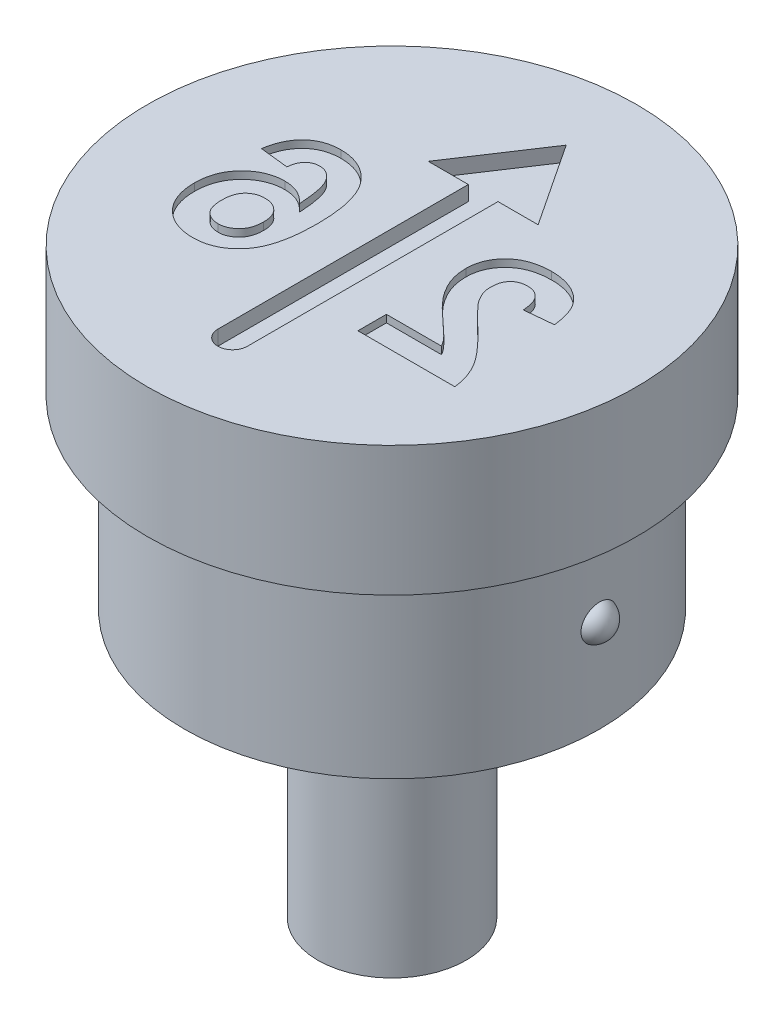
from build123d import *

# Parameters (mm, degrees)
CUT_EXTRUDE1_DEPTH = 0.4
CUT_EXTRUDE2_DEPTH = 0.2


with BuildPart() as part:
    # Sketch1 → Revolve1 (revolve)
    with BuildSketch(Plane.XY, mode=Mode.PRIVATE) as revolve1_sk:
        Polygon((0, 0), (-6.6, 0), (-6.6, -3.5), (-5.6, -3.5), (-5.6, -8.5), (-2, -8.5), (-2, -15.7), (0, -15.7), align=None)
    revolve(revolve1_sk.sketch.rotate(Axis((0, 0, 0), (0, -1, 0)), 270), axis=Axis((0, 0, 0), (0, -1, 0)))

    # Sketch3 → Cut-Extrude1 (cut)
    with BuildSketch(Plane(origin=(0, 0, 0), x_dir=(1, 0, 0), z_dir=(0, 1, 0))):
        with BuildLine():
            Line((0, 4.7), (-1.482623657, 2.46))
            Line((-1.482623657, 2.46), (-0.4, 2.46))
            Line((-0.4, 2.46), (-0.4, -4.3))
            ThreePointArc((-0.4, -4.3), (0, -4.7), (0.4, -4.3))
            Line((0.4, -4.3), (0.4, 2.46))
            Line((0.4, 2.46), (1.482623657, 2.46))
            Line((1.482623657, 2.46), (0, 4.7))
        make_face()
    extrude(amount=-CUT_EXTRUDE1_DEPTH, mode=Mode.SUBTRACT)

    # Sketch4 → Cut-Extrude2 (cut)
    # profile 1 of 2: a face of its own
    with BuildSketch(Plane(origin=(0, 0, 0), x_dir=(1, 0, 0), z_dir=(0, 1, 0))):
        with BuildLine():
            Line((1.528524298, -1.679177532), (1.528524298, -2.448408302))
            Line((1.528524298, -2.448408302), (4.143908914, -2.448408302))
            add(Edge.make_bspline(
                [(4.143908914, -2.448408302), (4.135053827, -2.382666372), (4.11734862, -2.251219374), (4.062610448, -2.059208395), (3.989553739, -1.871838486), (3.910264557, -1.719364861), (3.831402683, -1.596628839), (3.759851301, -1.496057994), (3.674493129, -1.389054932), (3.576566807, -1.274755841), (3.466613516, -1.152803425), (3.343812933, -1.023651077), (3.207579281, -0.887917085), (3.11173648, -0.795747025), (3.062178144, -0.748087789)],
                knots=[0, 0, 0, 0, 1.156289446, 2.311930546, 3.473459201, 4.661751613, 5.303057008, 6.018253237, 6.81459331, 7.690699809, 8.644447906, 9.679642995, 10.800191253, 12, 12, 12, 12], degree=3))
            add(Edge.make_bspline(
                [(3.062178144, -0.748087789), (3.022630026, -0.709913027), (2.947342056, -0.637239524), (2.840131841, -0.533174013), (2.745883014, -0.437508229), (2.662624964, -0.352721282), (2.592281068, -0.276654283), (2.533926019, -0.21050185), (2.486820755, -0.153994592), (2.461308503, -0.118146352), (2.449998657, -0.102254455)],
                knots=[0, 0, 0, 0, 1.480720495, 2.818855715, 4.024636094, 5.098235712, 6.019786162, 6.815086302, 7.474715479, 8, 8, 8, 8], degree=3))
            add(Edge.make_bspline(
                [(2.449998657, -0.102254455), (2.426838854, -0.063783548), (2.382166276, 0.010422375), (2.333179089, 0.127112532), (2.303775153, 0.243778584), (2.299740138, 0.321734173), (2.297755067, 0.360085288)],
                knots=[0, 0, 0, 0, 1.0911822, 2.104764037, 3.067617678, 4, 4, 4, 4], degree=3))
            add(Edge.make_bspline(
                [(2.297755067, 0.360085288), (2.299195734, 0.39999478), (2.301921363, 0.475500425), (2.324776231, 0.582052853), (2.36530563, 0.673649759), (2.421107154, 0.750572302), (2.491668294, 0.81084082), (2.574156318, 0.855373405), (2.669778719, 0.87999412), (2.736987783, 0.883232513), (2.772114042, 0.884925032)],
                knots=[0, 0, 0, 0, 1.193122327, 2.257294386, 3.237245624, 4.168877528, 5.075331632, 5.990371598, 6.949684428, 8, 8, 8, 8], degree=3))
            add(Edge.make_bspline(
                [(2.772114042, 0.884925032), (2.80700299, 0.883344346), (2.874400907, 0.880290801), (2.970187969, 0.853615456), (3.05398397, 0.807437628), (3.113701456, 0.754813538), (3.154043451, 0.703640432), (3.181531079, 0.659046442), (3.205223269, 0.608373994), (3.226216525, 0.552193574), (3.242798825, 0.489861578), (3.256153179, 0.421852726), (3.266914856, 0.347801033), (3.270337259, 0.29628539), (3.272114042, 0.269540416)],
                knots=[0, 0, 0, 0, 1.402788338, 2.709884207, 3.961032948, 5.225417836, 5.883680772, 6.578928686, 7.329201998, 8.132101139, 8.990263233, 9.922304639, 10.921339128, 12, 12, 12, 12], degree=3))
            Line((3.272114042, 0.269540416), (4.041344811, 0.344860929))
            add(Edge.make_bspline(
                [(4.041344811, 0.344860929), (4.035160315, 0.396793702), (4.023169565, 0.49748305), (3.993246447, 0.642107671), (3.955349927, 0.775530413), (3.90767335, 0.897503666), (3.852187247, 1.008803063), (3.786061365, 1.107758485), (3.711606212, 1.19546608), (3.628757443, 1.271879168), (3.538041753, 1.337240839), (3.442851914, 1.39558616), (3.34132765, 1.44344787), (3.234586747, 1.482893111), (3.122677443, 1.514417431), (3.005082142, 1.535260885), (2.882526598, 1.54992225), (2.798869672, 1.551026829), (2.756088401, 1.551591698)],
                knots=[0, 0, 0, 0, 1.270971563, 2.464210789, 3.586263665, 4.638946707, 5.643716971, 6.603612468, 7.52484387, 8.434700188, 9.336036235, 10.239171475, 11.145359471, 12.059630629, 13.003312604, 13.96741569, 14.960557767, 16, 16, 16, 16], degree=3))
            add(Edge.make_bspline(
                [(2.756088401, 1.551591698), (2.709579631, 1.550697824), (2.618997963, 1.548956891), (2.486764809, 1.534580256), (2.362541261, 1.50951251), (2.245241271, 1.476306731), (2.136069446, 1.431974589), (2.034116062, 1.378378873), (1.940985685, 1.313485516), (1.855290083, 1.24083343), (1.778685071, 1.160939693), (1.711586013, 1.075719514), (1.655370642, 0.985232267), (1.608197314, 0.890580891), (1.573171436, 0.790242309), (1.547650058, 0.685603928), (1.530728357, 0.576177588), (1.52926711, 0.50144188), (1.528524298, 0.463450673)],
                knots=[0, 0, 0, 0, 1.210756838, 2.35810096, 3.457354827, 4.507168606, 5.527358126, 6.519769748, 7.499700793, 8.476517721, 9.440526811, 10.376769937, 11.295256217, 12.209626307, 13.124630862, 14.055668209, 15.011616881, 16, 16, 16, 16], degree=3))
            add(Edge.make_bspline(
                [(1.528524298, 0.463450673), (1.529502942, 0.419848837), (1.531444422, 0.333349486), (1.550032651, 0.205477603), (1.578431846, 0.08055443), (1.620403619, -0.041725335), (1.6736061, -0.164294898), (1.742185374, -0.287429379), (1.821811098, -0.414842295), (1.884154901, -0.497220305), (1.916344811, -0.539754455)],
                knots=[0, 0, 0, 0, 0.953409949, 1.89141903, 2.821310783, 3.752688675, 4.715703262, 5.740811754, 6.833515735, 8, 8, 8, 8], degree=3))
            add(Edge.make_bspline(
                [(1.916344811, -0.539754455), (1.928511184, -0.555078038), (1.954568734, -0.587897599), (1.998899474, -0.638221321), (2.050274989, -0.69319069), (2.107969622, -0.753834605), (2.173889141, -0.818005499), (2.245661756, -0.888386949), (2.326445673, -0.96137871), (2.410118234, -1.038801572), (2.494154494, -1.114156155), (2.571395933, -1.185726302), (2.641556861, -1.249050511), (2.701369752, -1.307624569), (2.754352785, -1.357450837), (2.798596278, -1.40108435), (2.834928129, -1.437468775), (2.884991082, -1.494182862), (2.948690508, -1.570888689), (2.993505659, -1.644183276), (3.014902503, -1.679177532)],
                knots=[0, 0, 0, 0, 0.665555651, 1.425465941, 2.280616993, 3.225313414, 4.272635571, 5.410053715, 6.644756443, 7.976022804, 9.288331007, 10.484517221, 11.558462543, 12.503158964, 13.33222979, 14.032602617, 14.617328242, 15.080653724, 16.606167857, 18, 18, 18, 18], degree=3))
            Line((3.014902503, -1.679177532), (1.528524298, -1.679177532))
        make_face()
    # profile 2 of 2: a face of its own
    with BuildSketch(Plane(origin=(0, 0, 0), x_dir=(1, 0, 0), z_dir=(0, 1, 0))):
        with BuildLine():
            Line((-4.030450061, 0.507521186), (-3.261219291, 0.42338657))
            add(Edge.make_bspline(
                [(-3.261219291, 0.42338657), (-3.256065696, 0.460436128), (-3.24636757, 0.530156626), (-3.21764222, 0.626370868), (-3.177653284, 0.707311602), (-3.126323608, 0.773091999), (-3.065184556, 0.823719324), (-2.995519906, 0.859693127), (-2.917373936, 0.881048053), (-2.862585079, 0.883599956), (-2.834135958, 0.884925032)],
                knots=[0, 0, 0, 0, 1.280716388, 2.410074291, 3.425374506, 4.35753932, 5.248331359, 6.12451615, 7.026154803, 8, 8, 8, 8], degree=3))
            add(Edge.make_bspline(
                [(-2.834135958, 0.884925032), (-2.814843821, 0.884453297), (-2.776453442, 0.883514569), (-2.720533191, 0.871596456), (-2.666619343, 0.853909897), (-2.61515191, 0.828860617), (-2.565874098, 0.796539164), (-2.519535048, 0.756559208), (-2.47400436, 0.711028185), (-2.431961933, 0.65604734), (-2.391627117, 0.590946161), (-2.356897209, 0.51125004), (-2.325942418, 0.417033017), (-2.299438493, 0.307833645), (-2.275386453, 0.184345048), (-2.255670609, 0.046067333), (-2.239894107, -0.107123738), (-2.232325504, -0.214408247), (-2.228366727, -0.270523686)],
                knots=[0, 0, 0, 0, 0.642458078, 1.278459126, 1.898279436, 2.531842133, 3.181731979, 3.858193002, 4.57010051, 5.325711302, 6.161524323, 7.118599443, 8.217371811, 9.466325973, 10.864147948, 12.412648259, 14.123626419, 16, 16, 16, 16], degree=3))
            add(Edge.make_bspline(
                [(-2.228366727, -0.270523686), (-2.252951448, -0.24382144), (-2.301159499, -0.191461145), (-2.381151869, -0.123195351), (-2.46495578, -0.064832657), (-2.553483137, -0.016951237), (-2.647217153, 0.018680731), (-2.744459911, 0.045735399), (-2.846484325, 0.060890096), (-2.915819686, 0.063223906), (-2.951123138, 0.064412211)],
                knots=[0, 0, 0, 0, 1.057745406, 2.074127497, 3.059409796, 4.031705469, 5.000875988, 5.977809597, 6.970362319, 8, 8, 8, 8], degree=3))
            add(Edge.make_bspline(
                [(-2.951123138, 0.064412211), (-2.990966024, 0.063264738), (-3.069641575, 0.060998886), (-3.185548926, 0.045106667), (-3.296769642, 0.0165296), (-3.403806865, -0.022127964), (-3.50718962, -0.070807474), (-3.604940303, -0.132428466), (-3.698593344, -0.204275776), (-3.786860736, -0.286360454), (-3.867957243, -0.376728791), (-3.939557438, -0.474333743), (-3.998482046, -0.579473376), (-4.048855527, -0.68979377), (-4.08633532, -0.807472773), (-4.113541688, -0.930816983), (-4.129781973, -1.060958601), (-4.131919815, -1.149750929), (-4.133014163, -1.195203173)],
                knots=[0, 0, 0, 0, 0.99135015, 1.957564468, 2.903754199, 3.843479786, 4.78583385, 5.741106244, 6.712813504, 7.719198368, 8.735844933, 9.730198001, 10.724351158, 11.729813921, 12.742848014, 13.790983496, 14.86921809, 16, 16, 16, 16], degree=3))
            add(Edge.make_bspline(
                [(-4.133014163, -1.195203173), (-4.131903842, -1.243320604), (-4.129738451, -1.337161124), (-4.113799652, -1.474592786), (-4.085644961, -1.604312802), (-4.047179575, -1.727361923), (-3.997425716, -1.842765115), (-3.937152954, -1.951473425), (-3.86432161, -2.051629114), (-3.782236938, -2.144579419), (-3.690728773, -2.227525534), (-3.593207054, -2.300975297), (-3.488590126, -2.362031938), (-3.378424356, -2.413421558), (-3.260817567, -2.451134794), (-3.137843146, -2.479417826), (-3.008501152, -2.496667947), (-2.920193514, -2.498667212), (-2.875001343, -2.499690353)],
                knots=[0, 0, 0, 0, 1.13287417, 2.209376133, 3.25169942, 4.254157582, 5.240146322, 6.205890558, 7.174579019, 8.150183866, 9.1206468, 10.07783463, 11.019441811, 11.967766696, 12.934309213, 13.921380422, 14.936249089, 16, 16, 16, 16], degree=3))
            add(Edge.make_bspline(
                [(-2.875001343, -2.499690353), (-2.826578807, -2.498335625), (-2.731371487, -2.495671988), (-2.591998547, -2.473751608), (-2.459494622, -2.436665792), (-2.333876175, -2.384873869), (-2.214099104, -2.319727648), (-2.101275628, -2.238804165), (-1.995704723, -2.142875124), (-1.895990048, -2.033239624), (-1.805252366, -1.90660196), (-1.727979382, -1.760235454), (-1.662444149, -1.595743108), (-1.609088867, -1.412703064), (-1.567902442, -1.211129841), (-1.539163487, -0.991006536), (-1.520074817, -0.752697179), (-1.518463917, -0.587604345), (-1.517629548, -0.502094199)],
                knots=[0, 0, 0, 0, 0.852151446, 1.675481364, 2.476404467, 3.269281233, 4.062617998, 4.871616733, 5.707301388, 6.56955125, 7.476395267, 8.442009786, 9.475854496, 10.58877921, 11.794095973, 13.094195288, 14.494932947, 16, 16, 16, 16], degree=3))
            add(Edge.make_bspline(
                [(-1.517629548, -0.502094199), (-1.518825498, -0.41445169), (-1.521136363, -0.24510524), (-1.539731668, -0.000592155), (-1.569268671, 0.225205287), (-1.612296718, 0.431777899), (-1.667332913, 0.619554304), (-1.734055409, 0.788911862), (-1.814140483, 0.939237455), (-1.907251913, 1.070042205), (-2.00970132, 1.183745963), (-2.119783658, 1.28189161), (-2.237078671, 1.365428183), (-2.361583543, 1.434144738), (-2.494320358, 1.486238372), (-2.634030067, 1.523856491), (-2.780947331, 1.548033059), (-2.881583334, 1.550393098), (-2.93269365, 1.551591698)],
                knots=[0, 0, 0, 0, 1.491699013, 2.882321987, 4.171520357, 5.365488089, 6.470299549, 7.49861535, 8.458736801, 9.361983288, 10.224742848, 11.058789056, 11.867429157, 12.671146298, 13.473202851, 14.288259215, 15.130652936, 16, 16, 16, 16], degree=3))
            add(Edge.make_bspline(
                [(-2.93269365, 1.551591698), (-2.968794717, 1.550942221), (-3.039367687, 1.549672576), (-3.142802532, 1.536190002), (-3.241478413, 1.515572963), (-3.335653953, 1.487034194), (-3.42466609, 1.448815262), (-3.508868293, 1.402255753), (-3.588543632, 1.347481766), (-3.663277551, 1.284845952), (-3.732468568, 1.214158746), (-3.794946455, 1.135260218), (-3.85112497, 1.049102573), (-3.901249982, 0.955757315), (-3.943294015, 0.854330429), (-3.9794378, 0.745619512), (-4.009163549, 0.629391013), (-4.023246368, 0.548763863), (-4.030450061, 0.507521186)],
                knots=[0, 0, 0, 0, 1.036027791, 2.025301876, 2.989435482, 3.928225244, 4.845595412, 5.765526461, 6.686607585, 7.61747015, 8.561102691, 9.521661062, 10.50224679, 11.510949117, 12.559251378, 13.650572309, 14.798212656, 16, 16, 16, 16], degree=3))
        make_face()
        with BuildLine():
            add(Edge.make_bspline(
                [(-2.286860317, -1.177574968), (-2.287152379, -1.202979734), (-2.28772305, -1.25261919), (-2.297081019, -1.324649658), (-2.310532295, -1.39217693), (-2.328650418, -1.455575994), (-2.353763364, -1.513887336), (-2.383557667, -1.568280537), (-2.418800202, -1.618262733), (-2.472875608, -1.676906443), (-2.547597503, -1.738500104), (-2.645659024, -1.793349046), (-2.750729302, -1.827443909), (-2.823203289, -1.831152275), (-2.859776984, -1.833023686)],
                knots=[0, 0, 0, 0, 0.93816693, 1.833124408, 2.679057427, 3.481731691, 4.264557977, 5.020023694, 5.770442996, 6.518065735, 7.962605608, 9.32780964, 10.651490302, 12, 12, 12, 12], degree=3))
            add(Edge.make_bspline(
                [(-2.859776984, -1.833023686), (-2.894423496, -1.831468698), (-2.961859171, -1.828442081), (-3.058158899, -1.800781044), (-3.145632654, -1.757156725), (-3.209757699, -1.70594134), (-3.254470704, -1.656128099), (-3.284516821, -1.612443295), (-3.30897439, -1.562609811), (-3.328969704, -1.507448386), (-3.345075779, -1.447172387), (-3.356072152, -1.381176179), (-3.362309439, -1.309640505), (-3.363280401, -1.260119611), (-3.363783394, -1.234465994)],
                knots=[0, 0, 0, 0, 1.399678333, 2.724321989, 4.020062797, 5.33532049, 6.016755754, 6.724441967, 7.473839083, 8.257094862, 9.096253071, 9.995581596, 10.961638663, 12, 12, 12, 12], degree=3))
            add(Edge.make_bspline(
                [(-3.363783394, -1.234465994), (-3.363354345, -1.208006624), (-3.362524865, -1.156852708), (-3.355266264, -1.082918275), (-3.343391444, -1.014568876), (-3.326789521, -0.951321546), (-3.304317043, -0.894022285), (-3.277805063, -0.841515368), (-3.245617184, -0.795224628), (-3.197780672, -0.740780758), (-3.128224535, -0.685921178), (-3.035284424, -0.635952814), (-2.931108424, -0.60762542), (-2.858606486, -0.604078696), (-2.821315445, -0.602254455)],
                knots=[0, 0, 0, 0, 1.008384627, 1.949510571, 2.828269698, 3.650667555, 4.437180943, 5.170285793, 5.887596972, 6.580056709, 7.926803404, 9.238379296, 10.579573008, 12, 12, 12, 12], degree=3))
            add(Edge.make_bspline(
                [(-2.821315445, -0.602254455), (-2.785059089, -0.603731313), (-2.71464356, -0.606599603), (-2.613448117, -0.635403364), (-2.520853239, -0.68123512), (-2.452651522, -0.735078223), (-2.404581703, -0.78582363), (-2.373098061, -0.829029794), (-2.345693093, -0.876070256), (-2.324050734, -0.92816135), (-2.307364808, -0.98432555), (-2.295397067, -1.044946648), (-2.288154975, -1.10982361), (-2.287299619, -1.154585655), (-2.286860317, -1.177574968)],
                knots=[0, 0, 0, 0, 1.469034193, 2.853094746, 4.235454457, 5.641396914, 6.354997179, 7.06867986, 7.807229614, 8.560602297, 9.353235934, 10.182779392, 11.06669468, 12, 12, 12, 12], degree=3))
        make_face(mode=Mode.SUBTRACT)
    extrude(amount=-CUT_EXTRUDE2_DEPTH, mode=Mode.SUBTRACT)

    # Sketch5 → Revolve2 (revolve)
    with BuildSketch(Plane.XY):
        with BuildLine():
            Line((5.437297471, -5.5), (5.437297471, -6.5))
            ThreePointArc((5.437297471, -6.5), (5.937297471, -6), (5.437297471, -5.5))
        make_face()
    revolve(axis=Axis((5.437297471, -5.5, 0), (0, -1, 0)))


solid = part.part
